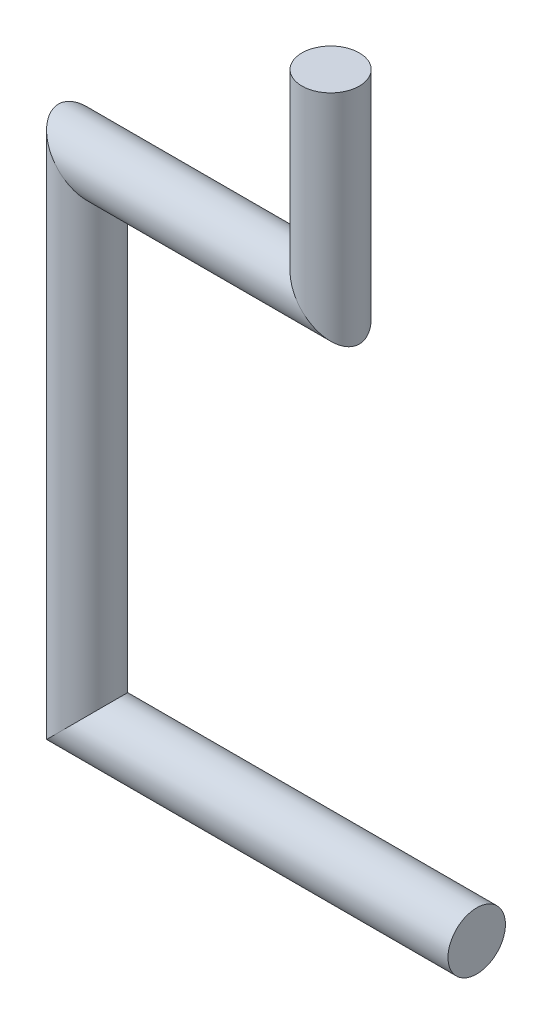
ISO-10303-21;
HEADER;
FILE_DESCRIPTION(('STEP AP214'),'2;1');
FILE_NAME('part.step','',(''),(''),'','','');
FILE_SCHEMA(('AUTOMOTIVE_DESIGN { 1 0 10303 214 1 1 1 1 }'));
ENDSEC;
DATA;
#1=APPLICATION_CONTEXT('core data for automotive mechanical design processes');
#2=APPLICATION_PROTOCOL_DEFINITION('international standard','automotive_design',2000,#1);
#3=PRODUCT_CONTEXT('',#1,'mechanical');
#4=PRODUCT('Part','Part','',(#3));
#5=PRODUCT_RELATED_PRODUCT_CATEGORY('part','',(#4));
#6=PRODUCT_DEFINITION_FORMATION('','',#4);
#7=PRODUCT_DEFINITION_CONTEXT('part definition',#1,'design');
#8=PRODUCT_DEFINITION('design','',#6,#7);
#9=PRODUCT_DEFINITION_SHAPE('','',#8);
#10=(LENGTH_UNIT() NAMED_UNIT(*) SI_UNIT(.MILLI.,.METRE.));
#11=(NAMED_UNIT(*) PLANE_ANGLE_UNIT() SI_UNIT($,.RADIAN.));
#12=(NAMED_UNIT(*) SI_UNIT($,.STERADIAN.) SOLID_ANGLE_UNIT());
#13=UNCERTAINTY_MEASURE_WITH_UNIT(LENGTH_MEASURE(1.E-05),#10,'distance_accuracy_value','');
#14=(GEOMETRIC_REPRESENTATION_CONTEXT(3) GLOBAL_UNCERTAINTY_ASSIGNED_CONTEXT((#13)) GLOBAL_UNIT_ASSIGNED_CONTEXT((#10,
#11,#12)) REPRESENTATION_CONTEXT('',''));
#15=CARTESIAN_POINT('',(0.,0.,0.));
#16=DIRECTION('',(0.,0.,1.));
#17=DIRECTION('',(1.,0.,0.));
#18=AXIS2_PLACEMENT_3D('',#15,#16,#17);
#19=CARTESIAN_POINT('',(101.6,0.,0.));
#20=DIRECTION('',(-1.,0.,0.));
#21=DIRECTION('',(0.,0.,1.));
#22=AXIS2_PLACEMENT_3D('',#19,#20,#21);
#23=PLANE('',#22);
#24=CARTESIAN_POINT('',(101.6,0.,0.));
#25=DIRECTION('',(-1.,0.,0.));
#26=DIRECTION('',(0.,0.,1.));
#27=AXIS2_PLACEMENT_3D('',#24,#25,#26);
#28=CIRCLE('',#27,7.493);
#29=CARTESIAN_POINT('',(101.6,0.,7.493));
#30=VERTEX_POINT('',#29);
#31=EDGE_CURVE('E40',#30,#30,#28,.T.);
#32=ORIENTED_EDGE('',*,*,#31,.F.);
#33=EDGE_LOOP('',(#32));
#34=FACE_BOUND('',#33,.T.);
#35=ADVANCED_FACE('F37',(#34),#23,.F.);
#36=CARTESIAN_POINT('',(63.5,177.8,0.));
#37=DIRECTION('',(0.,1.,0.));
#38=DIRECTION('',(0.,0.,1.));
#39=AXIS2_PLACEMENT_3D('',#36,#37,#38);
#40=PLANE('',#39);
#41=CARTESIAN_POINT('',(63.5,177.8,0.));
#42=DIRECTION('',(0.,1.,0.));
#43=DIRECTION('',(0.,0.,1.));
#44=AXIS2_PLACEMENT_3D('',#41,#42,#43);
#45=CIRCLE('',#44,7.493);
#46=CARTESIAN_POINT('',(63.5,177.8,7.493));
#47=VERTEX_POINT('',#46);
#48=EDGE_CURVE('E45',#47,#47,#45,.T.);
#49=ORIENTED_EDGE('',*,*,#48,.T.);
#50=EDGE_LOOP('',(#49));
#51=FACE_BOUND('',#50,.T.);
#52=ADVANCED_FACE('F68',(#51),#40,.T.);
#53=CARTESIAN_POINT('',(-16.5846,0.,0.));
#54=DIRECTION('',(1.,0.,0.));
#55=DIRECTION('',(0.,0.,-1.));
#56=AXIS2_PLACEMENT_3D('',#53,#54,#55);
#57=CYLINDRICAL_SURFACE('',#56,7.493);
#58=CARTESIAN_POINT('',(0.,0.,0.));
#59=DIRECTION('',(0.707106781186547,-0.707106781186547,0.));
#60=DIRECTION('',(-0.707106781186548,-0.707106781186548,0.));
#61=AXIS2_PLACEMENT_3D('',#58,#59,#60);
#62=ELLIPSE('',#61,10.5967022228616,7.493);
#63=CARTESIAN_POINT('',(-7.493,-7.493,0.));
#64=VERTEX_POINT('',#63);
#65=EDGE_CURVE('E56',#64,#64,#62,.T.);
#66=ORIENTED_EDGE('',*,*,#65,.T.);
#67=EDGE_LOOP('',(#66));
#68=FACE_BOUND('',#67,.T.);
#69=ORIENTED_EDGE('',*,*,#31,.T.);
#70=EDGE_LOOP('',(#69));
#71=FACE_BOUND('',#70,.T.);
#72=ADVANCED_FACE('F65',(#68,#71),#57,.T.);
#73=CARTESIAN_POINT('',(0.,143.5846,0.));
#74=DIRECTION('',(0.,-1.,0.));
#75=DIRECTION('',(0.,0.,-1.));
#76=AXIS2_PLACEMENT_3D('',#73,#74,#75);
#77=CYLINDRICAL_SURFACE('',#76,7.493);
#78=CARTESIAN_POINT('',(0.,127.,0.));
#79=DIRECTION('',(-0.707106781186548,-0.707106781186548,0.));
#80=DIRECTION('',(-0.707106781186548,0.707106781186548,0.));
#81=AXIS2_PLACEMENT_3D('',#78,#79,#80);
#82=ELLIPSE('',#81,10.5967022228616,7.493);
#83=CARTESIAN_POINT('',(-7.493,134.493,0.));
#84=VERTEX_POINT('',#83);
#85=EDGE_CURVE('E51',#84,#84,#82,.T.);
#86=ORIENTED_EDGE('',*,*,#85,.T.);
#87=EDGE_LOOP('',(#86));
#88=FACE_BOUND('',#87,.T.);
#89=ORIENTED_EDGE('',*,*,#65,.F.);
#90=EDGE_LOOP('',(#89));
#91=FACE_BOUND('',#90,.T.);
#92=ADVANCED_FACE('F81',(#88,#91),#77,.T.);
#93=CARTESIAN_POINT('',(80.0846,127.,0.));
#94=DIRECTION('',(-1.,0.,0.));
#95=DIRECTION('',(0.,0.,1.));
#96=AXIS2_PLACEMENT_3D('',#93,#94,#95);
#97=CYLINDRICAL_SURFACE('',#96,7.493);
#98=CARTESIAN_POINT('',(63.5,127.,0.));
#99=DIRECTION('',(-0.707106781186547,-0.707106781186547,0.));
#100=DIRECTION('',(0.707106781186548,-0.707106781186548,0.));
#101=AXIS2_PLACEMENT_3D('',#98,#99,#100);
#102=ELLIPSE('',#101,10.5967022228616,7.493);
#103=CARTESIAN_POINT('',(70.993,119.507,0.));
#104=VERTEX_POINT('',#103);
#105=EDGE_CURVE('E10',#104,#104,#102,.T.);
#106=ORIENTED_EDGE('',*,*,#105,.T.);
#107=EDGE_LOOP('',(#106));
#108=FACE_BOUND('',#107,.T.);
#109=ORIENTED_EDGE('',*,*,#85,.F.);
#110=EDGE_LOOP('',(#109));
#111=FACE_BOUND('',#110,.T.);
#112=ADVANCED_FACE('F75',(#108,#111),#97,.T.);
#113=CARTESIAN_POINT('',(63.5,177.8,0.));
#114=DIRECTION('',(0.,-1.,0.));
#115=DIRECTION('',(0.,0.,-1.));
#116=AXIS2_PLACEMENT_3D('',#113,#114,#115);
#117=CYLINDRICAL_SURFACE('',#116,7.493);
#118=ORIENTED_EDGE('',*,*,#48,.F.);
#119=EDGE_LOOP('',(#118));
#120=FACE_BOUND('',#119,.T.);
#121=ORIENTED_EDGE('',*,*,#105,.F.);
#122=EDGE_LOOP('',(#121));
#123=FACE_BOUND('',#122,.T.);
#124=ADVANCED_FACE('F73',(#120,#123),#117,.T.);
#125=CLOSED_SHELL('',(#35,#52,#72,#92,#112,#124));
#126=MANIFOLD_SOLID_BREP('B2',#125);
#127=ADVANCED_BREP_SHAPE_REPRESENTATION('',(#18,#126),#14);
#128=SHAPE_DEFINITION_REPRESENTATION(#9,#127);
ENDSEC;
END-ISO-10303-21;
